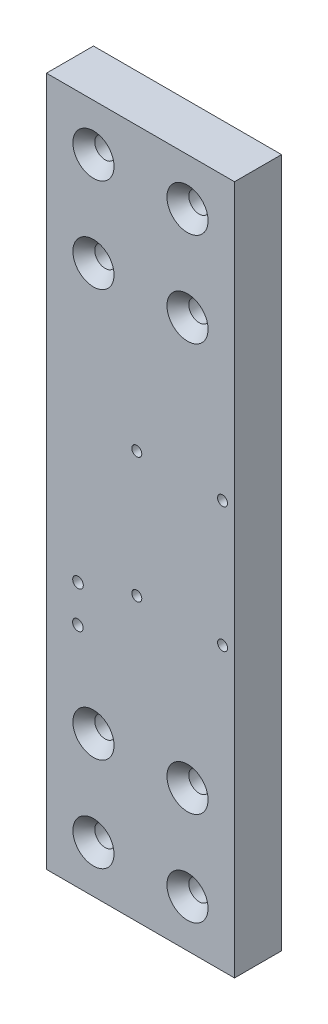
ISO-10303-21;
HEADER;
FILE_DESCRIPTION(('STEP AP214'),'2;1');
FILE_NAME('part.step','',(''),(''),'','','');
FILE_SCHEMA(('AUTOMOTIVE_DESIGN { 1 0 10303 214 1 1 1 1 }'));
ENDSEC;
DATA;
#1=APPLICATION_CONTEXT('core data for automotive mechanical design processes');
#2=APPLICATION_PROTOCOL_DEFINITION('international standard','automotive_design',2000,#1);
#3=PRODUCT_CONTEXT('',#1,'mechanical');
#4=PRODUCT('Part','Part','',(#3));
#5=PRODUCT_RELATED_PRODUCT_CATEGORY('part','',(#4));
#6=PRODUCT_DEFINITION_FORMATION('','',#4);
#7=PRODUCT_DEFINITION_CONTEXT('part definition',#1,'design');
#8=PRODUCT_DEFINITION('design','',#6,#7);
#9=PRODUCT_DEFINITION_SHAPE('','',#8);
#10=(LENGTH_UNIT() NAMED_UNIT(*) SI_UNIT(.MILLI.,.METRE.));
#11=(NAMED_UNIT(*) PLANE_ANGLE_UNIT() SI_UNIT($,.RADIAN.));
#12=(NAMED_UNIT(*) SI_UNIT($,.STERADIAN.) SOLID_ANGLE_UNIT());
#13=UNCERTAINTY_MEASURE_WITH_UNIT(LENGTH_MEASURE(1.E-05),#10,'distance_accuracy_value','');
#14=(GEOMETRIC_REPRESENTATION_CONTEXT(3) GLOBAL_UNCERTAINTY_ASSIGNED_CONTEXT((#13)) GLOBAL_UNIT_ASSIGNED_CONTEXT((#10,
#11,#12)) REPRESENTATION_CONTEXT('',''));
#15=CARTESIAN_POINT('',(0.,0.,0.));
#16=DIRECTION('',(0.,0.,1.));
#17=DIRECTION('',(1.,0.,0.));
#18=AXIS2_PLACEMENT_3D('',#15,#16,#17);
#19=CARTESIAN_POINT('',(-38.1,-139.7,19.05));
#20=DIRECTION('',(1.,0.,0.));
#21=DIRECTION('',(0.,0.,-1.));
#22=AXIS2_PLACEMENT_3D('',#19,#20,#21);
#23=PLANE('',#22);
#24=DIRECTION('',(0.,-1.,0.));
#25=VECTOR('',#24,1.);
#26=CARTESIAN_POINT('',(-38.1,-139.7,0.));
#27=LINE('',#26,#25);
#28=CARTESIAN_POINT('',(-38.1,139.7,0.));
#29=VERTEX_POINT('',#28);
#30=CARTESIAN_POINT('',(-38.1,-139.7,0.));
#31=VERTEX_POINT('',#30);
#32=EDGE_CURVE('E93',#29,#31,#27,.T.);
#33=ORIENTED_EDGE('',*,*,#32,.T.);
#34=DIRECTION('',(0.,0.,-1.));
#35=VECTOR('',#34,1.);
#36=CARTESIAN_POINT('',(-38.1,-139.7,19.05));
#37=LINE('',#36,#35);
#38=CARTESIAN_POINT('',(-38.1,-139.7,19.05));
#39=VERTEX_POINT('',#38);
#40=EDGE_CURVE('E11',#39,#31,#37,.T.);
#41=ORIENTED_EDGE('',*,*,#40,.F.);
#42=DIRECTION('',(0.,-1.,0.));
#43=VECTOR('',#42,1.);
#44=CARTESIAN_POINT('',(-38.1,-139.7,19.05));
#45=LINE('',#44,#43);
#46=CARTESIAN_POINT('',(-38.1,139.7,19.05));
#47=VERTEX_POINT('',#46);
#48=EDGE_CURVE('E81',#47,#39,#45,.T.);
#49=ORIENTED_EDGE('',*,*,#48,.F.);
#50=DIRECTION('',(0.,0.,-1.));
#51=VECTOR('',#50,1.);
#52=CARTESIAN_POINT('',(-38.1,139.7,19.05));
#53=LINE('',#52,#51);
#54=EDGE_CURVE('E89',#47,#29,#53,.T.);
#55=ORIENTED_EDGE('',*,*,#54,.T.);
#56=EDGE_LOOP('',(#33,#41,#49,#55));
#57=FACE_BOUND('',#56,.T.);
#58=ADVANCED_FACE('F30',(#57),#23,.F.);
#59=CARTESIAN_POINT('',(38.1,-139.7,19.05));
#60=DIRECTION('',(0.,1.,0.));
#61=DIRECTION('',(0.,0.,1.));
#62=AXIS2_PLACEMENT_3D('',#59,#60,#61);
#63=PLANE('',#62);
#64=DIRECTION('',(1.,0.,0.));
#65=VECTOR('',#64,1.);
#66=CARTESIAN_POINT('',(38.1,-139.7,0.));
#67=LINE('',#66,#65);
#68=CARTESIAN_POINT('',(38.1,-139.7,0.));
#69=VERTEX_POINT('',#68);
#70=EDGE_CURVE('E85',#31,#69,#67,.T.);
#71=ORIENTED_EDGE('',*,*,#70,.T.);
#72=DIRECTION('',(0.,0.,-1.));
#73=VECTOR('',#72,1.);
#74=CARTESIAN_POINT('',(38.1,-139.7,19.05));
#75=LINE('',#74,#73);
#76=CARTESIAN_POINT('',(38.1,-139.7,19.05));
#77=VERTEX_POINT('',#76);
#78=EDGE_CURVE('E38',#77,#69,#75,.T.);
#79=ORIENTED_EDGE('',*,*,#78,.F.);
#80=DIRECTION('',(1.,0.,0.));
#81=VECTOR('',#80,1.);
#82=CARTESIAN_POINT('',(38.1,-139.7,19.05));
#83=LINE('',#82,#81);
#84=EDGE_CURVE('E76',#39,#77,#83,.T.);
#85=ORIENTED_EDGE('',*,*,#84,.F.);
#86=ORIENTED_EDGE('',*,*,#40,.T.);
#87=EDGE_LOOP('',(#71,#79,#85,#86));
#88=FACE_BOUND('',#87,.T.);
#89=ADVANCED_FACE('F84',(#88),#63,.F.);
#90=CARTESIAN_POINT('',(38.1,-139.7,19.05));
#91=DIRECTION('',(-1.,0.,0.));
#92=DIRECTION('',(0.,0.,1.));
#93=AXIS2_PLACEMENT_3D('',#90,#91,#92);
#94=PLANE('',#93);
#95=DIRECTION('',(0.,1.,0.));
#96=VECTOR('',#95,1.);
#97=CARTESIAN_POINT('',(38.1,-139.7,0.));
#98=LINE('',#97,#96);
#99=CARTESIAN_POINT('',(38.1,139.7,0.));
#100=VERTEX_POINT('',#99);
#101=EDGE_CURVE('E63',#69,#100,#98,.T.);
#102=ORIENTED_EDGE('',*,*,#101,.T.);
#103=DIRECTION('',(0.,0.,-1.));
#104=VECTOR('',#103,1.);
#105=CARTESIAN_POINT('',(38.1,139.7,19.05));
#106=LINE('',#105,#104);
#107=CARTESIAN_POINT('',(38.1,139.7,19.05));
#108=VERTEX_POINT('',#107);
#109=EDGE_CURVE('E86',#108,#100,#106,.T.);
#110=ORIENTED_EDGE('',*,*,#109,.F.);
#111=DIRECTION('',(0.,1.,0.));
#112=VECTOR('',#111,1.);
#113=CARTESIAN_POINT('',(38.1,-139.7,19.05));
#114=LINE('',#113,#112);
#115=EDGE_CURVE('E79',#77,#108,#114,.T.);
#116=ORIENTED_EDGE('',*,*,#115,.F.);
#117=ORIENTED_EDGE('',*,*,#78,.T.);
#118=EDGE_LOOP('',(#102,#110,#116,#117));
#119=FACE_BOUND('',#118,.T.);
#120=ADVANCED_FACE('F87',(#119),#94,.F.);
#121=CARTESIAN_POINT('',(38.1,139.7,19.05));
#122=DIRECTION('',(0.,-1.,0.));
#123=DIRECTION('',(0.,0.,-1.));
#124=AXIS2_PLACEMENT_3D('',#121,#122,#123);
#125=PLANE('',#124);
#126=DIRECTION('',(-1.,0.,0.));
#127=VECTOR('',#126,1.);
#128=CARTESIAN_POINT('',(38.1,139.7,0.));
#129=LINE('',#128,#127);
#130=EDGE_CURVE('E69',#100,#29,#129,.T.);
#131=ORIENTED_EDGE('',*,*,#130,.T.);
#132=ORIENTED_EDGE('',*,*,#54,.F.);
#133=DIRECTION('',(-1.,0.,0.));
#134=VECTOR('',#133,1.);
#135=CARTESIAN_POINT('',(38.1,139.7,19.05));
#136=LINE('',#135,#134);
#137=EDGE_CURVE('E46',#108,#47,#136,.T.);
#138=ORIENTED_EDGE('',*,*,#137,.F.);
#139=ORIENTED_EDGE('',*,*,#109,.T.);
#140=EDGE_LOOP('',(#131,#132,#138,#139));
#141=FACE_BOUND('',#140,.T.);
#142=ADVANCED_FACE('F101',(#141),#125,.F.);
#143=CARTESIAN_POINT('',(-38.1,139.7,19.05));
#144=DIRECTION('',(0.,0.,1.));
#145=DIRECTION('',(1.,0.,0.));
#146=AXIS2_PLACEMENT_3D('',#143,#144,#145);
#147=PLANE('',#146);
#148=CARTESIAN_POINT('',(-25.3201625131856,-32.5656208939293,19.05));
#149=DIRECTION('',(0.,0.,1.));
#150=DIRECTION('',(1.,0.,0.));
#151=AXIS2_PLACEMENT_3D('',#148,#149,#150);
#152=CIRCLE('',#151,2.15264999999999);
#153=CARTESIAN_POINT('',(-23.1675125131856,-32.5656208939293,19.05));
#154=VERTEX_POINT('',#153);
#155=EDGE_CURVE('E211',#154,#154,#152,.T.);
#156=ORIENTED_EDGE('',*,*,#155,.F.);
#157=EDGE_LOOP('',(#156));
#158=FACE_BOUND('',#157,.T.);
#159=CARTESIAN_POINT('',(-25.3793685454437,-47.5776851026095,19.05));
#160=DIRECTION('',(0.,0.,1.));
#161=DIRECTION('',(1.,0.,0.));
#162=AXIS2_PLACEMENT_3D('',#159,#160,#161);
#163=CIRCLE('',#162,2.15264999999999);
#164=CARTESIAN_POINT('',(-23.2267185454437,-47.5776851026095,19.05));
#165=VERTEX_POINT('',#164);
#166=EDGE_CURVE('E205',#165,#165,#163,.T.);
#167=ORIENTED_EDGE('',*,*,#166,.F.);
#168=EDGE_LOOP('',(#167));
#169=FACE_BOUND('',#168,.T.);
#170=CARTESIAN_POINT('',(-1.4986,25.4,19.05));
#171=DIRECTION('',(0.,0.,-1.));
#172=DIRECTION('',(-1.,0.,0.));
#173=AXIS2_PLACEMENT_3D('',#170,#171,#172);
#174=CIRCLE('',#173,2.0193);
#175=CARTESIAN_POINT('',(-3.5179,25.4,19.05));
#176=VERTEX_POINT('',#175);
#177=EDGE_CURVE('E196',#176,#176,#174,.T.);
#178=ORIENTED_EDGE('',*,*,#177,.T.);
#179=EDGE_LOOP('',(#178));
#180=FACE_BOUND('',#179,.T.);
#181=CARTESIAN_POINT('',(33.2486,25.4,19.05));
#182=DIRECTION('',(0.,0.,-1.));
#183=DIRECTION('',(-1.,0.,0.));
#184=AXIS2_PLACEMENT_3D('',#181,#182,#183);
#185=CIRCLE('',#184,2.01929999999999);
#186=CARTESIAN_POINT('',(31.2293,25.4,19.05));
#187=VERTEX_POINT('',#186);
#188=EDGE_CURVE('E190',#187,#187,#185,.T.);
#189=ORIENTED_EDGE('',*,*,#188,.T.);
#190=EDGE_LOOP('',(#189));
#191=FACE_BOUND('',#190,.T.);
#192=CARTESIAN_POINT('',(-1.4986,-25.4,19.05));
#193=DIRECTION('',(0.,0.,-1.));
#194=DIRECTION('',(-1.,0.,0.));
#195=AXIS2_PLACEMENT_3D('',#192,#193,#194);
#196=CIRCLE('',#195,2.0193);
#197=CARTESIAN_POINT('',(-3.5179,-25.4,19.05));
#198=VERTEX_POINT('',#197);
#199=EDGE_CURVE('E184',#198,#198,#196,.T.);
#200=ORIENTED_EDGE('',*,*,#199,.T.);
#201=EDGE_LOOP('',(#200));
#202=FACE_BOUND('',#201,.T.);
#203=CARTESIAN_POINT('',(33.2486,-25.4,19.05));
#204=DIRECTION('',(0.,0.,-1.));
#205=DIRECTION('',(-1.,0.,0.));
#206=AXIS2_PLACEMENT_3D('',#203,#204,#205);
#207=CIRCLE('',#206,2.01929999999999);
#208=CARTESIAN_POINT('',(31.2293,-25.4,19.05));
#209=VERTEX_POINT('',#208);
#210=EDGE_CURVE('E178',#209,#209,#207,.T.);
#211=ORIENTED_EDGE('',*,*,#210,.T.);
#212=EDGE_LOOP('',(#211));
#213=FACE_BOUND('',#212,.T.);
#214=CARTESIAN_POINT('',(19.05,82.55,19.05));
#215=DIRECTION('',(0.,0.,1.));
#216=DIRECTION('',(1.,0.,0.));
#217=AXIS2_PLACEMENT_3D('',#214,#215,#216);
#218=CIRCLE('',#217,8.3312);
#219=CARTESIAN_POINT('',(27.3812,82.55,19.05));
#220=VERTEX_POINT('',#219);
#221=EDGE_CURVE('E175',#220,#220,#218,.T.);
#222=ORIENTED_EDGE('',*,*,#221,.F.);
#223=EDGE_LOOP('',(#222));
#224=FACE_BOUND('',#223,.T.);
#225=CARTESIAN_POINT('',(-19.05,82.55,19.05));
#226=DIRECTION('',(0.,0.,1.));
#227=DIRECTION('',(1.,0.,0.));
#228=AXIS2_PLACEMENT_3D('',#225,#226,#227);
#229=CIRCLE('',#228,8.3312);
#230=CARTESIAN_POINT('',(-10.7188,82.55,19.05));
#231=VERTEX_POINT('',#230);
#232=EDGE_CURVE('E166',#231,#231,#229,.T.);
#233=ORIENTED_EDGE('',*,*,#232,.F.);
#234=EDGE_LOOP('',(#233));
#235=FACE_BOUND('',#234,.T.);
#236=CARTESIAN_POINT('',(19.05,120.65,19.05));
#237=DIRECTION('',(0.,0.,1.));
#238=DIRECTION('',(1.,0.,0.));
#239=AXIS2_PLACEMENT_3D('',#236,#237,#238);
#240=CIRCLE('',#239,8.3312);
#241=CARTESIAN_POINT('',(27.3812,120.65,19.05));
#242=VERTEX_POINT('',#241);
#243=EDGE_CURVE('E157',#242,#242,#240,.T.);
#244=ORIENTED_EDGE('',*,*,#243,.F.);
#245=EDGE_LOOP('',(#244));
#246=FACE_BOUND('',#245,.T.);
#247=CARTESIAN_POINT('',(-19.05,120.65,19.05));
#248=DIRECTION('',(0.,0.,1.));
#249=DIRECTION('',(1.,0.,0.));
#250=AXIS2_PLACEMENT_3D('',#247,#248,#249);
#251=CIRCLE('',#250,8.3312);
#252=CARTESIAN_POINT('',(-10.7188,120.65,19.05));
#253=VERTEX_POINT('',#252);
#254=EDGE_CURVE('E148',#253,#253,#251,.T.);
#255=ORIENTED_EDGE('',*,*,#254,.F.);
#256=EDGE_LOOP('',(#255));
#257=FACE_BOUND('',#256,.T.);
#258=CARTESIAN_POINT('',(19.05,-82.55,19.05));
#259=DIRECTION('',(0.,0.,1.));
#260=DIRECTION('',(1.,0.,0.));
#261=AXIS2_PLACEMENT_3D('',#258,#259,#260);
#262=CIRCLE('',#261,8.3312);
#263=CARTESIAN_POINT('',(27.3812,-82.55,19.05));
#264=VERTEX_POINT('',#263);
#265=EDGE_CURVE('E139',#264,#264,#262,.T.);
#266=ORIENTED_EDGE('',*,*,#265,.F.);
#267=EDGE_LOOP('',(#266));
#268=FACE_BOUND('',#267,.T.);
#269=CARTESIAN_POINT('',(-19.05,-82.55,19.05));
#270=DIRECTION('',(0.,0.,1.));
#271=DIRECTION('',(1.,0.,0.));
#272=AXIS2_PLACEMENT_3D('',#269,#270,#271);
#273=CIRCLE('',#272,8.3312);
#274=CARTESIAN_POINT('',(-10.7188,-82.55,19.05));
#275=VERTEX_POINT('',#274);
#276=EDGE_CURVE('E130',#275,#275,#273,.T.);
#277=ORIENTED_EDGE('',*,*,#276,.F.);
#278=EDGE_LOOP('',(#277));
#279=FACE_BOUND('',#278,.T.);
#280=CARTESIAN_POINT('',(19.05,-120.65,19.05));
#281=DIRECTION('',(0.,0.,1.));
#282=DIRECTION('',(1.,0.,0.));
#283=AXIS2_PLACEMENT_3D('',#280,#281,#282);
#284=CIRCLE('',#283,8.3312);
#285=CARTESIAN_POINT('',(27.3812,-120.65,19.05));
#286=VERTEX_POINT('',#285);
#287=EDGE_CURVE('E121',#286,#286,#284,.T.);
#288=ORIENTED_EDGE('',*,*,#287,.F.);
#289=EDGE_LOOP('',(#288));
#290=FACE_BOUND('',#289,.T.);
#291=CARTESIAN_POINT('',(-19.05,-120.65,19.05));
#292=DIRECTION('',(0.,0.,1.));
#293=DIRECTION('',(1.,0.,0.));
#294=AXIS2_PLACEMENT_3D('',#291,#292,#293);
#295=CIRCLE('',#294,8.3312);
#296=CARTESIAN_POINT('',(-10.7188,-120.65,19.05));
#297=VERTEX_POINT('',#296);
#298=EDGE_CURVE('E112',#297,#297,#295,.T.);
#299=ORIENTED_EDGE('',*,*,#298,.F.);
#300=EDGE_LOOP('',(#299));
#301=FACE_BOUND('',#300,.T.);
#302=ORIENTED_EDGE('',*,*,#48,.T.);
#303=ORIENTED_EDGE('',*,*,#84,.T.);
#304=ORIENTED_EDGE('',*,*,#115,.T.);
#305=ORIENTED_EDGE('',*,*,#137,.T.);
#306=EDGE_LOOP('',(#302,#303,#304,#305));
#307=FACE_BOUND('',#306,.T.);
#308=ADVANCED_FACE('F77',(#158,#169,#180,#191,#202,#213,#224,#235,#246,#257,#268,#279,#290,#301,
#307),#147,.T.);
#309=CARTESIAN_POINT('',(-38.1,139.7,0.));
#310=DIRECTION('',(0.,0.,1.));
#311=DIRECTION('',(1.,0.,0.));
#312=AXIS2_PLACEMENT_3D('',#309,#310,#311);
#313=PLANE('',#312);
#314=CARTESIAN_POINT('',(-25.3201625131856,-32.5656208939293,0.));
#315=DIRECTION('',(0.,0.,1.));
#316=DIRECTION('',(1.,0.,0.));
#317=AXIS2_PLACEMENT_3D('',#314,#315,#316);
#318=CIRCLE('',#317,2.15265);
#319=CARTESIAN_POINT('',(-23.1675125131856,-32.5656208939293,0.));
#320=VERTEX_POINT('',#319);
#321=EDGE_CURVE('E208',#320,#320,#318,.T.);
#322=ORIENTED_EDGE('',*,*,#321,.T.);
#323=EDGE_LOOP('',(#322));
#324=FACE_BOUND('',#323,.T.);
#325=CARTESIAN_POINT('',(-25.3793685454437,-47.5776851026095,0.));
#326=DIRECTION('',(0.,0.,1.));
#327=DIRECTION('',(1.,0.,0.));
#328=AXIS2_PLACEMENT_3D('',#325,#326,#327);
#329=CIRCLE('',#328,2.15265);
#330=CARTESIAN_POINT('',(-23.2267185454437,-47.5776851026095,0.));
#331=VERTEX_POINT('',#330);
#332=EDGE_CURVE('E202',#331,#331,#329,.T.);
#333=ORIENTED_EDGE('',*,*,#332,.T.);
#334=EDGE_LOOP('',(#333));
#335=FACE_BOUND('',#334,.T.);
#336=CARTESIAN_POINT('',(-1.4986,25.4,0.));
#337=DIRECTION('',(0.,0.,-1.));
#338=DIRECTION('',(-1.,0.,0.));
#339=AXIS2_PLACEMENT_3D('',#336,#337,#338);
#340=CIRCLE('',#339,2.01929999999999);
#341=CARTESIAN_POINT('',(-3.51789999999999,25.4,0.));
#342=VERTEX_POINT('',#341);
#343=EDGE_CURVE('E199',#342,#342,#340,.T.);
#344=ORIENTED_EDGE('',*,*,#343,.F.);
#345=EDGE_LOOP('',(#344));
#346=FACE_BOUND('',#345,.T.);
#347=CARTESIAN_POINT('',(33.2486,25.4,0.));
#348=DIRECTION('',(0.,0.,-1.));
#349=DIRECTION('',(-1.,0.,0.));
#350=AXIS2_PLACEMENT_3D('',#347,#348,#349);
#351=CIRCLE('',#350,2.01929999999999);
#352=CARTESIAN_POINT('',(31.2293,25.4,0.));
#353=VERTEX_POINT('',#352);
#354=EDGE_CURVE('E193',#353,#353,#351,.T.);
#355=ORIENTED_EDGE('',*,*,#354,.F.);
#356=EDGE_LOOP('',(#355));
#357=FACE_BOUND('',#356,.T.);
#358=CARTESIAN_POINT('',(-1.4986,-25.4,0.));
#359=DIRECTION('',(0.,0.,-1.));
#360=DIRECTION('',(-1.,0.,0.));
#361=AXIS2_PLACEMENT_3D('',#358,#359,#360);
#362=CIRCLE('',#361,2.01929999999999);
#363=CARTESIAN_POINT('',(-3.51789999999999,-25.4,0.));
#364=VERTEX_POINT('',#363);
#365=EDGE_CURVE('E187',#364,#364,#362,.T.);
#366=ORIENTED_EDGE('',*,*,#365,.F.);
#367=EDGE_LOOP('',(#366));
#368=FACE_BOUND('',#367,.T.);
#369=CARTESIAN_POINT('',(33.2486,-25.4,0.));
#370=DIRECTION('',(0.,0.,-1.));
#371=DIRECTION('',(-1.,0.,0.));
#372=AXIS2_PLACEMENT_3D('',#369,#370,#371);
#373=CIRCLE('',#372,2.01929999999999);
#374=CARTESIAN_POINT('',(31.2293,-25.4,0.));
#375=VERTEX_POINT('',#374);
#376=EDGE_CURVE('E181',#375,#375,#373,.T.);
#377=ORIENTED_EDGE('',*,*,#376,.F.);
#378=EDGE_LOOP('',(#377));
#379=FACE_BOUND('',#378,.T.);
#380=CARTESIAN_POINT('',(19.05,82.55,0.));
#381=DIRECTION('',(0.,0.,1.));
#382=DIRECTION('',(1.,0.,0.));
#383=AXIS2_PLACEMENT_3D('',#380,#381,#382);
#384=CIRCLE('',#383,4.21639999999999);
#385=CARTESIAN_POINT('',(23.2664,82.55,0.));
#386=VERTEX_POINT('',#385);
#387=EDGE_CURVE('E169',#386,#386,#384,.T.);
#388=ORIENTED_EDGE('',*,*,#387,.T.);
#389=EDGE_LOOP('',(#388));
#390=FACE_BOUND('',#389,.T.);
#391=CARTESIAN_POINT('',(-19.05,82.55,0.));
#392=DIRECTION('',(0.,0.,1.));
#393=DIRECTION('',(1.,0.,0.));
#394=AXIS2_PLACEMENT_3D('',#391,#392,#393);
#395=CIRCLE('',#394,4.21639999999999);
#396=CARTESIAN_POINT('',(-14.8336,82.55,0.));
#397=VERTEX_POINT('',#396);
#398=EDGE_CURVE('E160',#397,#397,#395,.T.);
#399=ORIENTED_EDGE('',*,*,#398,.T.);
#400=EDGE_LOOP('',(#399));
#401=FACE_BOUND('',#400,.T.);
#402=CARTESIAN_POINT('',(19.05,120.65,0.));
#403=DIRECTION('',(0.,0.,1.));
#404=DIRECTION('',(1.,0.,0.));
#405=AXIS2_PLACEMENT_3D('',#402,#403,#404);
#406=CIRCLE('',#405,4.21639999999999);
#407=CARTESIAN_POINT('',(23.2664,120.65,0.));
#408=VERTEX_POINT('',#407);
#409=EDGE_CURVE('E151',#408,#408,#406,.T.);
#410=ORIENTED_EDGE('',*,*,#409,.T.);
#411=EDGE_LOOP('',(#410));
#412=FACE_BOUND('',#411,.T.);
#413=CARTESIAN_POINT('',(-19.05,120.65,0.));
#414=DIRECTION('',(0.,0.,1.));
#415=DIRECTION('',(1.,0.,0.));
#416=AXIS2_PLACEMENT_3D('',#413,#414,#415);
#417=CIRCLE('',#416,4.21639999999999);
#418=CARTESIAN_POINT('',(-14.8336,120.65,0.));
#419=VERTEX_POINT('',#418);
#420=EDGE_CURVE('E142',#419,#419,#417,.T.);
#421=ORIENTED_EDGE('',*,*,#420,.T.);
#422=EDGE_LOOP('',(#421));
#423=FACE_BOUND('',#422,.T.);
#424=CARTESIAN_POINT('',(19.05,-82.55,0.));
#425=DIRECTION('',(0.,0.,1.));
#426=DIRECTION('',(1.,0.,0.));
#427=AXIS2_PLACEMENT_3D('',#424,#425,#426);
#428=CIRCLE('',#427,4.21639999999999);
#429=CARTESIAN_POINT('',(23.2664,-82.55,0.));
#430=VERTEX_POINT('',#429);
#431=EDGE_CURVE('E133',#430,#430,#428,.T.);
#432=ORIENTED_EDGE('',*,*,#431,.T.);
#433=EDGE_LOOP('',(#432));
#434=FACE_BOUND('',#433,.T.);
#435=CARTESIAN_POINT('',(-19.05,-82.55,0.));
#436=DIRECTION('',(0.,0.,1.));
#437=DIRECTION('',(1.,0.,0.));
#438=AXIS2_PLACEMENT_3D('',#435,#436,#437);
#439=CIRCLE('',#438,4.21639999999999);
#440=CARTESIAN_POINT('',(-14.8336,-82.55,0.));
#441=VERTEX_POINT('',#440);
#442=EDGE_CURVE('E124',#441,#441,#439,.T.);
#443=ORIENTED_EDGE('',*,*,#442,.T.);
#444=EDGE_LOOP('',(#443));
#445=FACE_BOUND('',#444,.T.);
#446=CARTESIAN_POINT('',(19.05,-120.65,0.));
#447=DIRECTION('',(0.,0.,1.));
#448=DIRECTION('',(1.,0.,0.));
#449=AXIS2_PLACEMENT_3D('',#446,#447,#448);
#450=CIRCLE('',#449,4.21639999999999);
#451=CARTESIAN_POINT('',(23.2664,-120.65,0.));
#452=VERTEX_POINT('',#451);
#453=EDGE_CURVE('E115',#452,#452,#450,.T.);
#454=ORIENTED_EDGE('',*,*,#453,.T.);
#455=EDGE_LOOP('',(#454));
#456=FACE_BOUND('',#455,.T.);
#457=CARTESIAN_POINT('',(-19.05,-120.65,0.));
#458=DIRECTION('',(0.,0.,1.));
#459=DIRECTION('',(1.,0.,0.));
#460=AXIS2_PLACEMENT_3D('',#457,#458,#459);
#461=CIRCLE('',#460,4.21639999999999);
#462=CARTESIAN_POINT('',(-14.8336,-120.65,0.));
#463=VERTEX_POINT('',#462);
#464=EDGE_CURVE('E96',#463,#463,#461,.T.);
#465=ORIENTED_EDGE('',*,*,#464,.T.);
#466=EDGE_LOOP('',(#465));
#467=FACE_BOUND('',#466,.T.);
#468=ORIENTED_EDGE('',*,*,#32,.F.);
#469=ORIENTED_EDGE('',*,*,#130,.F.);
#470=ORIENTED_EDGE('',*,*,#101,.F.);
#471=ORIENTED_EDGE('',*,*,#70,.F.);
#472=EDGE_LOOP('',(#468,#469,#470,#471));
#473=FACE_BOUND('',#472,.T.);
#474=ADVANCED_FACE('F104',(#324,#335,#346,#357,#368,#379,#390,#401,#412,#423,#434,#445,#456,
#467,#473),#313,.F.);
#475=CARTESIAN_POINT('',(-19.05,-120.65,19.05));
#476=DIRECTION('',(0.,0.,1.));
#477=DIRECTION('',(1.,0.,0.));
#478=AXIS2_PLACEMENT_3D('',#475,#476,#477);
#479=CYLINDRICAL_SURFACE('',#478,4.2164);
#480=ORIENTED_EDGE('',*,*,#464,.F.);
#481=EDGE_LOOP('',(#480));
#482=FACE_BOUND('',#481,.T.);
#483=CARTESIAN_POINT('',(-19.05,-120.65,14.316464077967));
#484=DIRECTION('',(0.,0.,1.));
#485=DIRECTION('',(1.,0.,0.));
#486=AXIS2_PLACEMENT_3D('',#483,#484,#485);
#487=CIRCLE('',#486,4.2164);
#488=CARTESIAN_POINT('',(-14.8336,-120.65,14.316464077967));
#489=VERTEX_POINT('',#488);
#490=EDGE_CURVE('E109',#489,#489,#487,.T.);
#491=ORIENTED_EDGE('',*,*,#490,.T.);
#492=EDGE_LOOP('',(#491));
#493=FACE_BOUND('',#492,.T.);
#494=ADVANCED_FACE('F249',(#482,#493),#479,.F.);
#495=CARTESIAN_POINT('',(-19.05,-120.65,19.05));
#496=DIRECTION('',(0.,0.,1.));
#497=DIRECTION('',(1.,0.,0.));
#498=AXIS2_PLACEMENT_3D('',#495,#496,#497);
#499=CONICAL_SURFACE('',#498,8.3312,0.715584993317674);
#500=ORIENTED_EDGE('',*,*,#490,.F.);
#501=EDGE_LOOP('',(#500));
#502=FACE_BOUND('',#501,.T.);
#503=ORIENTED_EDGE('',*,*,#298,.T.);
#504=EDGE_LOOP('',(#503));
#505=FACE_BOUND('',#504,.T.);
#506=ADVANCED_FACE('F246',(#502,#505),#499,.F.);
#507=CARTESIAN_POINT('',(19.05,-120.65,19.05));
#508=DIRECTION('',(0.,0.,1.));
#509=DIRECTION('',(1.,0.,0.));
#510=AXIS2_PLACEMENT_3D('',#507,#508,#509);
#511=CYLINDRICAL_SURFACE('',#510,4.2164);
#512=ORIENTED_EDGE('',*,*,#453,.F.);
#513=EDGE_LOOP('',(#512));
#514=FACE_BOUND('',#513,.T.);
#515=CARTESIAN_POINT('',(19.05,-120.65,14.316464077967));
#516=DIRECTION('',(0.,0.,1.));
#517=DIRECTION('',(1.,0.,0.));
#518=AXIS2_PLACEMENT_3D('',#515,#516,#517);
#519=CIRCLE('',#518,4.2164);
#520=CARTESIAN_POINT('',(23.2664,-120.65,14.316464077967));
#521=VERTEX_POINT('',#520);
#522=EDGE_CURVE('E118',#521,#521,#519,.T.);
#523=ORIENTED_EDGE('',*,*,#522,.T.);
#524=EDGE_LOOP('',(#523));
#525=FACE_BOUND('',#524,.T.);
#526=ADVANCED_FACE('F248',(#514,#525),#511,.F.);
#527=CARTESIAN_POINT('',(19.05,-120.65,19.05));
#528=DIRECTION('',(0.,0.,1.));
#529=DIRECTION('',(1.,0.,0.));
#530=AXIS2_PLACEMENT_3D('',#527,#528,#529);
#531=CONICAL_SURFACE('',#530,8.3312,0.715584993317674);
#532=ORIENTED_EDGE('',*,*,#522,.F.);
#533=EDGE_LOOP('',(#532));
#534=FACE_BOUND('',#533,.T.);
#535=ORIENTED_EDGE('',*,*,#287,.T.);
#536=EDGE_LOOP('',(#535));
#537=FACE_BOUND('',#536,.T.);
#538=ADVANCED_FACE('F256',(#534,#537),#531,.F.);
#539=CARTESIAN_POINT('',(-19.05,-82.55,19.05));
#540=DIRECTION('',(0.,0.,1.));
#541=DIRECTION('',(1.,0.,0.));
#542=AXIS2_PLACEMENT_3D('',#539,#540,#541);
#543=CYLINDRICAL_SURFACE('',#542,4.2164);
#544=ORIENTED_EDGE('',*,*,#442,.F.);
#545=EDGE_LOOP('',(#544));
#546=FACE_BOUND('',#545,.T.);
#547=CARTESIAN_POINT('',(-19.05,-82.55,14.316464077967));
#548=DIRECTION('',(0.,0.,1.));
#549=DIRECTION('',(1.,0.,0.));
#550=AXIS2_PLACEMENT_3D('',#547,#548,#549);
#551=CIRCLE('',#550,4.2164);
#552=CARTESIAN_POINT('',(-14.8336,-82.55,14.316464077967));
#553=VERTEX_POINT('',#552);
#554=EDGE_CURVE('E127',#553,#553,#551,.T.);
#555=ORIENTED_EDGE('',*,*,#554,.T.);
#556=EDGE_LOOP('',(#555));
#557=FACE_BOUND('',#556,.T.);
#558=ADVANCED_FACE('F310',(#546,#557),#543,.F.);
#559=CARTESIAN_POINT('',(-19.05,-82.55,19.05));
#560=DIRECTION('',(0.,0.,1.));
#561=DIRECTION('',(1.,0.,0.));
#562=AXIS2_PLACEMENT_3D('',#559,#560,#561);
#563=CONICAL_SURFACE('',#562,8.3312,0.715584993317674);
#564=ORIENTED_EDGE('',*,*,#554,.F.);
#565=EDGE_LOOP('',(#564));
#566=FACE_BOUND('',#565,.T.);
#567=ORIENTED_EDGE('',*,*,#276,.T.);
#568=EDGE_LOOP('',(#567));
#569=FACE_BOUND('',#568,.T.);
#570=ADVANCED_FACE('F315',(#566,#569),#563,.F.);
#571=CARTESIAN_POINT('',(19.05,-82.55,19.05));
#572=DIRECTION('',(0.,0.,1.));
#573=DIRECTION('',(1.,0.,0.));
#574=AXIS2_PLACEMENT_3D('',#571,#572,#573);
#575=CYLINDRICAL_SURFACE('',#574,4.2164);
#576=ORIENTED_EDGE('',*,*,#431,.F.);
#577=EDGE_LOOP('',(#576));
#578=FACE_BOUND('',#577,.T.);
#579=CARTESIAN_POINT('',(19.05,-82.55,14.316464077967));
#580=DIRECTION('',(0.,0.,1.));
#581=DIRECTION('',(1.,0.,0.));
#582=AXIS2_PLACEMENT_3D('',#579,#580,#581);
#583=CIRCLE('',#582,4.2164);
#584=CARTESIAN_POINT('',(23.2664,-82.55,14.316464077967));
#585=VERTEX_POINT('',#584);
#586=EDGE_CURVE('E136',#585,#585,#583,.T.);
#587=ORIENTED_EDGE('',*,*,#586,.T.);
#588=EDGE_LOOP('',(#587));
#589=FACE_BOUND('',#588,.T.);
#590=ADVANCED_FACE('F321',(#578,#589),#575,.F.);
#591=CARTESIAN_POINT('',(19.05,-82.55,19.05));
#592=DIRECTION('',(0.,0.,1.));
#593=DIRECTION('',(1.,0.,0.));
#594=AXIS2_PLACEMENT_3D('',#591,#592,#593);
#595=CONICAL_SURFACE('',#594,8.3312,0.715584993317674);
#596=ORIENTED_EDGE('',*,*,#586,.F.);
#597=EDGE_LOOP('',(#596));
#598=FACE_BOUND('',#597,.T.);
#599=ORIENTED_EDGE('',*,*,#265,.T.);
#600=EDGE_LOOP('',(#599));
#601=FACE_BOUND('',#600,.T.);
#602=ADVANCED_FACE('F325',(#598,#601),#595,.F.);
#603=CARTESIAN_POINT('',(-19.05,120.65,19.05));
#604=DIRECTION('',(0.,0.,1.));
#605=DIRECTION('',(1.,0.,0.));
#606=AXIS2_PLACEMENT_3D('',#603,#604,#605);
#607=CYLINDRICAL_SURFACE('',#606,4.2164);
#608=ORIENTED_EDGE('',*,*,#420,.F.);
#609=EDGE_LOOP('',(#608));
#610=FACE_BOUND('',#609,.T.);
#611=CARTESIAN_POINT('',(-19.05,120.65,14.316464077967));
#612=DIRECTION('',(0.,0.,1.));
#613=DIRECTION('',(1.,0.,0.));
#614=AXIS2_PLACEMENT_3D('',#611,#612,#613);
#615=CIRCLE('',#614,4.2164);
#616=CARTESIAN_POINT('',(-14.8336,120.65,14.316464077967));
#617=VERTEX_POINT('',#616);
#618=EDGE_CURVE('E145',#617,#617,#615,.T.);
#619=ORIENTED_EDGE('',*,*,#618,.T.);
#620=EDGE_LOOP('',(#619));
#621=FACE_BOUND('',#620,.T.);
#622=ADVANCED_FACE('F329',(#610,#621),#607,.F.);
#623=CARTESIAN_POINT('',(-19.05,120.65,19.05));
#624=DIRECTION('',(0.,0.,1.));
#625=DIRECTION('',(1.,0.,0.));
#626=AXIS2_PLACEMENT_3D('',#623,#624,#625);
#627=CONICAL_SURFACE('',#626,8.3312,0.715584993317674);
#628=ORIENTED_EDGE('',*,*,#618,.F.);
#629=EDGE_LOOP('',(#628));
#630=FACE_BOUND('',#629,.T.);
#631=ORIENTED_EDGE('',*,*,#254,.T.);
#632=EDGE_LOOP('',(#631));
#633=FACE_BOUND('',#632,.T.);
#634=ADVANCED_FACE('F333',(#630,#633),#627,.F.);
#635=CARTESIAN_POINT('',(19.05,120.65,19.05));
#636=DIRECTION('',(0.,0.,1.));
#637=DIRECTION('',(1.,0.,0.));
#638=AXIS2_PLACEMENT_3D('',#635,#636,#637);
#639=CYLINDRICAL_SURFACE('',#638,4.2164);
#640=ORIENTED_EDGE('',*,*,#409,.F.);
#641=EDGE_LOOP('',(#640));
#642=FACE_BOUND('',#641,.T.);
#643=CARTESIAN_POINT('',(19.05,120.65,14.316464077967));
#644=DIRECTION('',(0.,0.,1.));
#645=DIRECTION('',(1.,0.,0.));
#646=AXIS2_PLACEMENT_3D('',#643,#644,#645);
#647=CIRCLE('',#646,4.2164);
#648=CARTESIAN_POINT('',(23.2664,120.65,14.316464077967));
#649=VERTEX_POINT('',#648);
#650=EDGE_CURVE('E154',#649,#649,#647,.T.);
#651=ORIENTED_EDGE('',*,*,#650,.T.);
#652=EDGE_LOOP('',(#651));
#653=FACE_BOUND('',#652,.T.);
#654=ADVANCED_FACE('F337',(#642,#653),#639,.F.);
#655=CARTESIAN_POINT('',(19.05,120.65,19.05));
#656=DIRECTION('',(0.,0.,1.));
#657=DIRECTION('',(1.,0.,0.));
#658=AXIS2_PLACEMENT_3D('',#655,#656,#657);
#659=CONICAL_SURFACE('',#658,8.3312,0.715584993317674);
#660=ORIENTED_EDGE('',*,*,#650,.F.);
#661=EDGE_LOOP('',(#660));
#662=FACE_BOUND('',#661,.T.);
#663=ORIENTED_EDGE('',*,*,#243,.T.);
#664=EDGE_LOOP('',(#663));
#665=FACE_BOUND('',#664,.T.);
#666=ADVANCED_FACE('F341',(#662,#665),#659,.F.);
#667=CARTESIAN_POINT('',(-19.05,82.55,19.05));
#668=DIRECTION('',(0.,0.,1.));
#669=DIRECTION('',(1.,0.,0.));
#670=AXIS2_PLACEMENT_3D('',#667,#668,#669);
#671=CYLINDRICAL_SURFACE('',#670,4.2164);
#672=ORIENTED_EDGE('',*,*,#398,.F.);
#673=EDGE_LOOP('',(#672));
#674=FACE_BOUND('',#673,.T.);
#675=CARTESIAN_POINT('',(-19.05,82.55,14.316464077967));
#676=DIRECTION('',(0.,0.,1.));
#677=DIRECTION('',(1.,0.,0.));
#678=AXIS2_PLACEMENT_3D('',#675,#676,#677);
#679=CIRCLE('',#678,4.2164);
#680=CARTESIAN_POINT('',(-14.8336,82.55,14.316464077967));
#681=VERTEX_POINT('',#680);
#682=EDGE_CURVE('E163',#681,#681,#679,.T.);
#683=ORIENTED_EDGE('',*,*,#682,.T.);
#684=EDGE_LOOP('',(#683));
#685=FACE_BOUND('',#684,.T.);
#686=ADVANCED_FACE('F345',(#674,#685),#671,.F.);
#687=CARTESIAN_POINT('',(-19.05,82.55,19.05));
#688=DIRECTION('',(0.,0.,1.));
#689=DIRECTION('',(1.,0.,0.));
#690=AXIS2_PLACEMENT_3D('',#687,#688,#689);
#691=CONICAL_SURFACE('',#690,8.3312,0.715584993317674);
#692=ORIENTED_EDGE('',*,*,#682,.F.);
#693=EDGE_LOOP('',(#692));
#694=FACE_BOUND('',#693,.T.);
#695=ORIENTED_EDGE('',*,*,#232,.T.);
#696=EDGE_LOOP('',(#695));
#697=FACE_BOUND('',#696,.T.);
#698=ADVANCED_FACE('F349',(#694,#697),#691,.F.);
#699=CARTESIAN_POINT('',(19.05,82.55,19.05));
#700=DIRECTION('',(0.,0.,1.));
#701=DIRECTION('',(1.,0.,0.));
#702=AXIS2_PLACEMENT_3D('',#699,#700,#701);
#703=CYLINDRICAL_SURFACE('',#702,4.2164);
#704=ORIENTED_EDGE('',*,*,#387,.F.);
#705=EDGE_LOOP('',(#704));
#706=FACE_BOUND('',#705,.T.);
#707=CARTESIAN_POINT('',(19.05,82.55,14.316464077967));
#708=DIRECTION('',(0.,0.,1.));
#709=DIRECTION('',(1.,0.,0.));
#710=AXIS2_PLACEMENT_3D('',#707,#708,#709);
#711=CIRCLE('',#710,4.2164);
#712=CARTESIAN_POINT('',(23.2664,82.55,14.316464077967));
#713=VERTEX_POINT('',#712);
#714=EDGE_CURVE('E172',#713,#713,#711,.T.);
#715=ORIENTED_EDGE('',*,*,#714,.T.);
#716=EDGE_LOOP('',(#715));
#717=FACE_BOUND('',#716,.T.);
#718=ADVANCED_FACE('F353',(#706,#717),#703,.F.);
#719=CARTESIAN_POINT('',(19.05,82.55,19.05));
#720=DIRECTION('',(0.,0.,1.));
#721=DIRECTION('',(1.,0.,0.));
#722=AXIS2_PLACEMENT_3D('',#719,#720,#721);
#723=CONICAL_SURFACE('',#722,8.3312,0.715584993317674);
#724=ORIENTED_EDGE('',*,*,#714,.F.);
#725=EDGE_LOOP('',(#724));
#726=FACE_BOUND('',#725,.T.);
#727=ORIENTED_EDGE('',*,*,#221,.T.);
#728=EDGE_LOOP('',(#727));
#729=FACE_BOUND('',#728,.T.);
#730=ADVANCED_FACE('F357',(#726,#729),#723,.F.);
#731=CARTESIAN_POINT('',(33.2486,-25.4,0.));
#732=DIRECTION('',(0.,0.,-1.));
#733=DIRECTION('',(-1.,0.,0.));
#734=AXIS2_PLACEMENT_3D('',#731,#732,#733);
#735=CYLINDRICAL_SURFACE('',#734,2.01929999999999);
#736=ORIENTED_EDGE('',*,*,#210,.F.);
#737=EDGE_LOOP('',(#736));
#738=FACE_BOUND('',#737,.T.);
#739=ORIENTED_EDGE('',*,*,#376,.T.);
#740=EDGE_LOOP('',(#739));
#741=FACE_BOUND('',#740,.T.);
#742=ADVANCED_FACE('F361',(#738,#741),#735,.F.);
#743=CARTESIAN_POINT('',(-1.4986,-25.4,0.));
#744=DIRECTION('',(0.,0.,-1.));
#745=DIRECTION('',(-1.,0.,0.));
#746=AXIS2_PLACEMENT_3D('',#743,#744,#745);
#747=CYLINDRICAL_SURFACE('',#746,2.01929999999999);
#748=ORIENTED_EDGE('',*,*,#199,.F.);
#749=EDGE_LOOP('',(#748));
#750=FACE_BOUND('',#749,.T.);
#751=ORIENTED_EDGE('',*,*,#365,.T.);
#752=EDGE_LOOP('',(#751));
#753=FACE_BOUND('',#752,.T.);
#754=ADVANCED_FACE('F365',(#750,#753),#747,.F.);
#755=CARTESIAN_POINT('',(33.2486,25.4,0.));
#756=DIRECTION('',(0.,0.,-1.));
#757=DIRECTION('',(-1.,0.,0.));
#758=AXIS2_PLACEMENT_3D('',#755,#756,#757);
#759=CYLINDRICAL_SURFACE('',#758,2.01929999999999);
#760=ORIENTED_EDGE('',*,*,#188,.F.);
#761=EDGE_LOOP('',(#760));
#762=FACE_BOUND('',#761,.T.);
#763=ORIENTED_EDGE('',*,*,#354,.T.);
#764=EDGE_LOOP('',(#763));
#765=FACE_BOUND('',#764,.T.);
#766=ADVANCED_FACE('F369',(#762,#765),#759,.F.);
#767=CARTESIAN_POINT('',(-1.4986,25.4,0.));
#768=DIRECTION('',(0.,0.,-1.));
#769=DIRECTION('',(-1.,0.,0.));
#770=AXIS2_PLACEMENT_3D('',#767,#768,#769);
#771=CYLINDRICAL_SURFACE('',#770,2.01929999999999);
#772=ORIENTED_EDGE('',*,*,#177,.F.);
#773=EDGE_LOOP('',(#772));
#774=FACE_BOUND('',#773,.T.);
#775=ORIENTED_EDGE('',*,*,#343,.T.);
#776=EDGE_LOOP('',(#775));
#777=FACE_BOUND('',#776,.T.);
#778=ADVANCED_FACE('F373',(#774,#777),#771,.F.);
#779=CARTESIAN_POINT('',(-25.3793685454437,-47.5776851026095,19.05));
#780=DIRECTION('',(0.,0.,1.));
#781=DIRECTION('',(1.,0.,0.));
#782=AXIS2_PLACEMENT_3D('',#779,#780,#781);
#783=CYLINDRICAL_SURFACE('',#782,2.15264999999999);
#784=ORIENTED_EDGE('',*,*,#332,.F.);
#785=EDGE_LOOP('',(#784));
#786=FACE_BOUND('',#785,.T.);
#787=ORIENTED_EDGE('',*,*,#166,.T.);
#788=EDGE_LOOP('',(#787));
#789=FACE_BOUND('',#788,.T.);
#790=ADVANCED_FACE('F377',(#786,#789),#783,.F.);
#791=CARTESIAN_POINT('',(-25.3201625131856,-32.5656208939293,19.05));
#792=DIRECTION('',(0.,0.,1.));
#793=DIRECTION('',(1.,0.,0.));
#794=AXIS2_PLACEMENT_3D('',#791,#792,#793);
#795=CYLINDRICAL_SURFACE('',#794,2.15264999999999);
#796=ORIENTED_EDGE('',*,*,#321,.F.);
#797=EDGE_LOOP('',(#796));
#798=FACE_BOUND('',#797,.T.);
#799=ORIENTED_EDGE('',*,*,#155,.T.);
#800=EDGE_LOOP('',(#799));
#801=FACE_BOUND('',#800,.T.);
#802=ADVANCED_FACE('F215',(#798,#801),#795,.F.);
#803=CLOSED_SHELL('',(#58,#89,#120,#142,#308,#474,#494,#506,#526,#538,#558,#570,#590,#602,#622,
#634,#654,#666,#686,#698,#718,#730,#742,#754,#766,#778,#790,#802));
#804=MANIFOLD_SOLID_BREP('B2',#803);
#805=ADVANCED_BREP_SHAPE_REPRESENTATION('',(#18,#804),#14);
#806=SHAPE_DEFINITION_REPRESENTATION(#9,#805);
ENDSEC;
END-ISO-10303-21;
